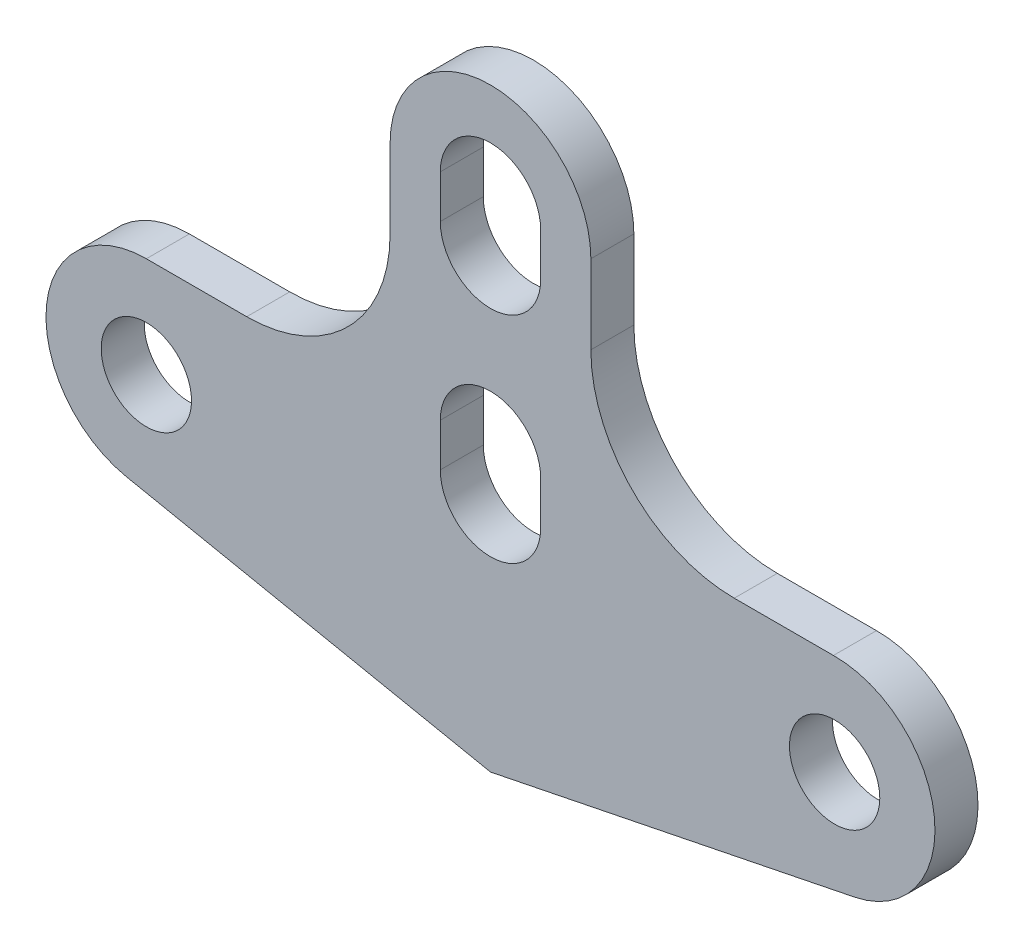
from build123d import *

# Parameters (mm, degrees)
ESQUISSE1_R      = 3.15
EXTRUSION2_DEPTH = 3


with BuildPart() as part:
    # Esquisse1 → Extrusion2 (new body)
    with BuildSketch(Plane.XY):
        with BuildLine():
            Line((-7, 0), (-7, -5.5))
            ThreePointArc((-7, -5.5), (-9.928932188, -12.571067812), (-17, -15.5))
            Line((-17, -15.5), (-24, -15.5))
            ThreePointArc((-24, -15.5), (-30.965127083, -21.802142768), (-25.388761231, -29.360855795))
            Line((-25.388761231, -29.360855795), (0, -34.5))
            Line((0, -34.5), (25.388761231, -29.360855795))
            ThreePointArc((25.388761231, -29.360855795), (30.960866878, -21.760857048), (23.916991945, -15.500492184))
            Line((23.916991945, -15.500492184), (17, -15.500492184))
            ThreePointArc((17, -15.500492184), (9.928932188, -12.571559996), (7, -5.500492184))
            Line((7, -5.500492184), (7, 0))
            ThreePointArc((7, 0), (3.680474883, 5.954334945), (-3.129744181, 6.261365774))
            ThreePointArc((-3.129744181, 6.261365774), (-5.954334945, 3.680474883), (-7, 0))
        make_face()
        with Locations((-24, -22.5)):
            Circle(ESQUISSE1_R, mode=Mode.SUBTRACT)
        with Locations((24, -22.5)):
            Circle(ESQUISSE1_R, mode=Mode.SUBTRACT)
        with BuildLine():
            Line((3.5, -15), (3.5, -18))
            ThreePointArc((3.5, -18), (0, -21.5), (-3.5, -18))
            Line((-3.5, -18), (-3.5, -15))
            ThreePointArc((-3.5, -15), (0, -11.5), (3.5, -15))
        make_face(mode=Mode.SUBTRACT)
        with BuildLine():
            Line((3.5, 0), (3.5, -3))
            ThreePointArc((3.5, -3), (0, -6.5), (-3.5, -3))
            Line((-3.5, -3), (-3.5, 0))
            ThreePointArc((-3.5, 0), (0, 3.5), (3.5, 0))
        make_face(mode=Mode.SUBTRACT)
    extrude(amount=EXTRUSION2_DEPTH)


solid = part.part
